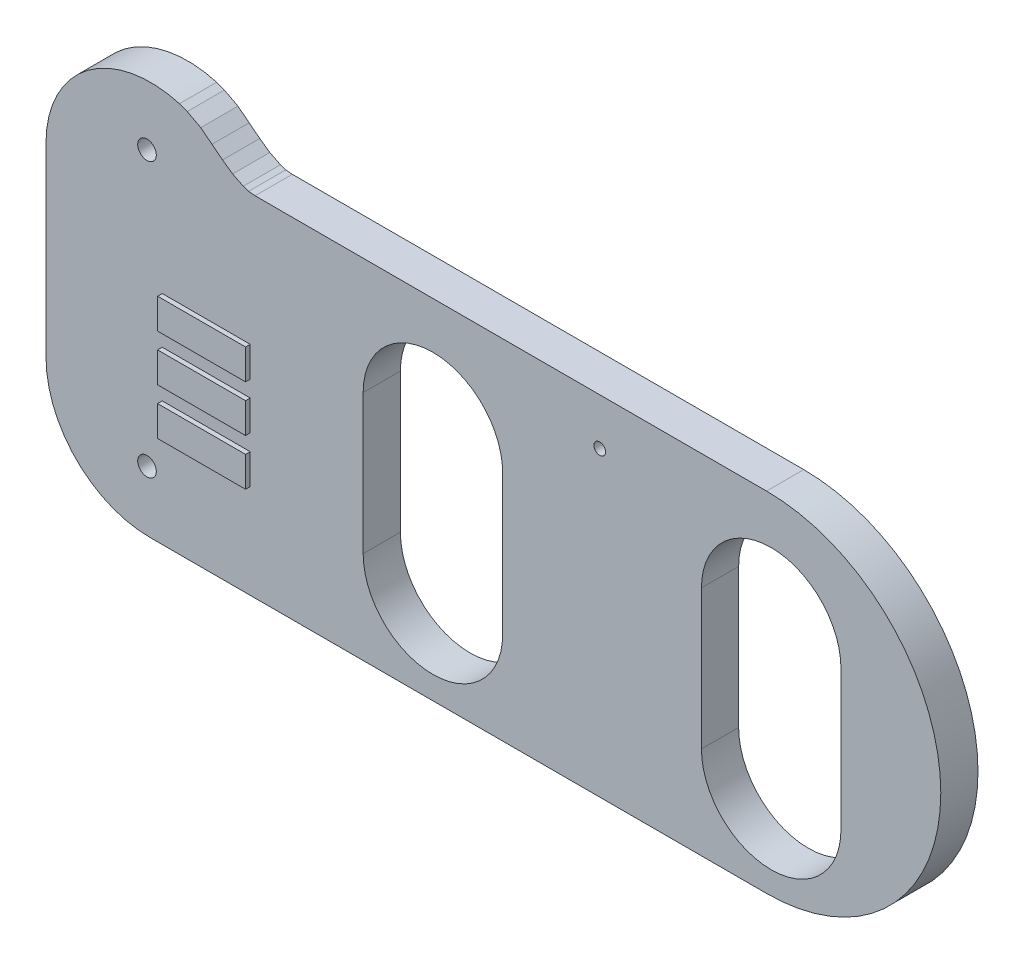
ISO-10303-21;
HEADER;
FILE_DESCRIPTION(('STEP AP214'),'2;1');
FILE_NAME('part.step','',(''),(''),'','','');
FILE_SCHEMA(('AUTOMOTIVE_DESIGN { 1 0 10303 214 1 1 1 1 }'));
ENDSEC;
DATA;
#1=APPLICATION_CONTEXT('core data for automotive mechanical design processes');
#2=APPLICATION_PROTOCOL_DEFINITION('international standard','automotive_design',2000,#1);
#3=PRODUCT_CONTEXT('',#1,'mechanical');
#4=PRODUCT('Part','Part','',(#3));
#5=PRODUCT_RELATED_PRODUCT_CATEGORY('part','',(#4));
#6=PRODUCT_DEFINITION_FORMATION('','',#4);
#7=PRODUCT_DEFINITION_CONTEXT('part definition',#1,'design');
#8=PRODUCT_DEFINITION('design','',#6,#7);
#9=PRODUCT_DEFINITION_SHAPE('','',#8);
#10=(LENGTH_UNIT() NAMED_UNIT(*) SI_UNIT(.MILLI.,.METRE.));
#11=(NAMED_UNIT(*) PLANE_ANGLE_UNIT() SI_UNIT($,.RADIAN.));
#12=(NAMED_UNIT(*) SI_UNIT($,.STERADIAN.) SOLID_ANGLE_UNIT());
#13=UNCERTAINTY_MEASURE_WITH_UNIT(LENGTH_MEASURE(1.E-05),#10,'distance_accuracy_value','');
#14=(GEOMETRIC_REPRESENTATION_CONTEXT(3) GLOBAL_UNCERTAINTY_ASSIGNED_CONTEXT((#13)) GLOBAL_UNIT_ASSIGNED_CONTEXT((#10,
#11,#12)) REPRESENTATION_CONTEXT('',''));
#15=CARTESIAN_POINT('',(0.,0.,0.));
#16=DIRECTION('',(0.,0.,1.));
#17=DIRECTION('',(1.,0.,0.));
#18=AXIS2_PLACEMENT_3D('',#15,#16,#17);
#19=CARTESIAN_POINT('',(-10.0383025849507,7.19083929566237,1.6));
#20=DIRECTION('',(-0.576683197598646,-0.816967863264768,0.));
#21=DIRECTION('',(0.816967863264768,-0.576683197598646,0.));
#22=AXIS2_PLACEMENT_3D('',#19,#20,#21);
#23=PLANE('',#22);
#24=DIRECTION('',(0.,0.,1.));
#25=VECTOR('',#24,1.);
#26=CARTESIAN_POINT('',(-10.4701025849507,7.49563929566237,1.6));
#27=LINE('',#26,#25);
#28=CARTESIAN_POINT('',(-10.4701025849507,7.49563929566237,0.));
#29=VERTEX_POINT('',#28);
#30=CARTESIAN_POINT('',(-10.4701025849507,7.49563929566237,1.6));
#31=VERTEX_POINT('',#30);
#32=EDGE_CURVE('E331',#29,#31,#27,.T.);
#33=ORIENTED_EDGE('',*,*,#32,.T.);
#34=DIRECTION('',(0.816967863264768,-0.576683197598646,0.));
#35=VECTOR('',#34,1.);
#36=CARTESIAN_POINT('',(-10.0383025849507,7.19083929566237,1.6));
#37=LINE('',#36,#35);
#38=CARTESIAN_POINT('',(-10.0383025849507,7.19083929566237,1.6));
#39=VERTEX_POINT('',#38);
#40=EDGE_CURVE('E341',#39,#31,#37,.F.);
#41=ORIENTED_EDGE('',*,*,#40,.F.);
#42=DIRECTION('',(0.,0.,1.));
#43=VECTOR('',#42,1.);
#44=CARTESIAN_POINT('',(-10.0383025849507,7.19083929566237,1.6));
#45=LINE('',#44,#43);
#46=CARTESIAN_POINT('',(-10.0383025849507,7.19083929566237,0.));
#47=VERTEX_POINT('',#46);
#48=EDGE_CURVE('E311',#39,#47,#45,.F.);
#49=ORIENTED_EDGE('',*,*,#48,.T.);
#50=DIRECTION('',(0.816967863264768,-0.576683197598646,0.));
#51=VECTOR('',#50,1.);
#52=CARTESIAN_POINT('',(-10.0383025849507,7.19083929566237,0.));
#53=LINE('',#52,#51);
#54=EDGE_CURVE('E338',#29,#47,#53,.T.);
#55=ORIENTED_EDGE('',*,*,#54,.F.);
#56=EDGE_LOOP('',(#33,#41,#49,#55));
#57=FACE_BOUND('',#56,.T.);
#58=ADVANCED_FACE('F17',(#57),#23,.F.);
#59=CARTESIAN_POINT('',(-10.4701025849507,7.49563929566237,1.6));
#60=DIRECTION('',(-0.613940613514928,-0.78935221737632,0.));
#61=DIRECTION('',(0.78935221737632,-0.613940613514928,0.));
#62=AXIS2_PLACEMENT_3D('',#59,#60,#61);
#63=PLANE('',#62);
#64=DIRECTION('',(0.,0.,1.));
#65=VECTOR('',#64,1.);
#66=CARTESIAN_POINT('',(-10.9273025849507,7.85123929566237,1.6));
#67=LINE('',#66,#65);
#68=CARTESIAN_POINT('',(-10.9273025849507,7.85123929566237,0.));
#69=VERTEX_POINT('',#68);
#70=CARTESIAN_POINT('',(-10.9273025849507,7.85123929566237,1.6));
#71=VERTEX_POINT('',#70);
#72=EDGE_CURVE('E301',#69,#71,#67,.T.);
#73=ORIENTED_EDGE('',*,*,#72,.T.);
#74=DIRECTION('',(0.78935221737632,-0.613940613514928,0.));
#75=VECTOR('',#74,1.);
#76=CARTESIAN_POINT('',(-10.4701025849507,7.49563929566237,1.6));
#77=LINE('',#76,#75);
#78=EDGE_CURVE('E326',#31,#71,#77,.F.);
#79=ORIENTED_EDGE('',*,*,#78,.F.);
#80=ORIENTED_EDGE('',*,*,#32,.F.);
#81=DIRECTION('',(0.78935221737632,-0.613940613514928,0.));
#82=VECTOR('',#81,1.);
#83=CARTESIAN_POINT('',(-10.4701025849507,7.49563929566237,0.));
#84=LINE('',#83,#82);
#85=EDGE_CURVE('E317',#69,#29,#84,.T.);
#86=ORIENTED_EDGE('',*,*,#85,.F.);
#87=EDGE_LOOP('',(#73,#79,#80,#86));
#88=FACE_BOUND('',#87,.T.);
#89=ADVANCED_FACE('F655',(#88),#63,.F.);
#90=CARTESIAN_POINT('',(-9.58110258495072,6.96223929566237,1.6));
#91=DIRECTION('',(-0.447213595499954,-0.894427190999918,0.));
#92=DIRECTION('',(0.894427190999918,-0.447213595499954,0.));
#93=AXIS2_PLACEMENT_3D('',#90,#91,#92);
#94=PLANE('',#93);
#95=ORIENTED_EDGE('',*,*,#48,.F.);
#96=DIRECTION('',(0.894427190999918,-0.447213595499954,0.));
#97=VECTOR('',#96,1.);
#98=CARTESIAN_POINT('',(-9.58110258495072,6.96223929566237,1.6));
#99=LINE('',#98,#97);
#100=CARTESIAN_POINT('',(-9.58110258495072,6.96223929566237,1.6));
#101=VERTEX_POINT('',#100);
#102=EDGE_CURVE('E314',#101,#39,#99,.F.);
#103=ORIENTED_EDGE('',*,*,#102,.F.);
#104=DIRECTION('',(0.,0.,1.));
#105=VECTOR('',#104,1.);
#106=CARTESIAN_POINT('',(-9.58110258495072,6.96223929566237,1.6));
#107=LINE('',#106,#105);
#108=CARTESIAN_POINT('',(-9.58110258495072,6.96223929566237,0.));
#109=VERTEX_POINT('',#108);
#110=EDGE_CURVE('E272',#101,#109,#107,.F.);
#111=ORIENTED_EDGE('',*,*,#110,.T.);
#112=DIRECTION('',(0.894427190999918,-0.447213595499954,0.));
#113=VECTOR('',#112,1.);
#114=CARTESIAN_POINT('',(-9.58110258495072,6.96223929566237,0.));
#115=LINE('',#114,#113);
#116=EDGE_CURVE('E308',#47,#109,#115,.T.);
#117=ORIENTED_EDGE('',*,*,#116,.F.);
#118=EDGE_LOOP('',(#95,#103,#111,#117));
#119=FACE_BOUND('',#118,.T.);
#120=ADVANCED_FACE('F652',(#119),#94,.F.);
#121=CARTESIAN_POINT('',(-10.9273025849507,7.85123929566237,1.6));
#122=DIRECTION('',(-0.61964428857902,-0.784882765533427,0.));
#123=DIRECTION('',(0.784882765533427,-0.61964428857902,0.));
#124=AXIS2_PLACEMENT_3D('',#121,#122,#123);
#125=PLANE('',#124);
#126=DIRECTION('',(0.,0.,1.));
#127=VECTOR('',#126,1.);
#128=CARTESIAN_POINT('',(-11.4099025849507,8.23223929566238,1.6));
#129=LINE('',#128,#127);
#130=CARTESIAN_POINT('',(-11.4099025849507,8.23223929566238,0.));
#131=VERTEX_POINT('',#130);
#132=CARTESIAN_POINT('',(-11.4099025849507,8.23223929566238,1.6));
#133=VERTEX_POINT('',#132);
#134=EDGE_CURVE('E266',#131,#133,#129,.T.);
#135=ORIENTED_EDGE('',*,*,#134,.T.);
#136=DIRECTION('',(0.784882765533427,-0.61964428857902,0.));
#137=VECTOR('',#136,1.);
#138=CARTESIAN_POINT('',(-10.9273025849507,7.85123929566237,1.6));
#139=LINE('',#138,#137);
#140=EDGE_CURVE('E296',#71,#133,#139,.F.);
#141=ORIENTED_EDGE('',*,*,#140,.F.);
#142=ORIENTED_EDGE('',*,*,#72,.F.);
#143=DIRECTION('',(0.784882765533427,-0.61964428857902,0.));
#144=VECTOR('',#143,1.);
#145=CARTESIAN_POINT('',(-10.9273025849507,7.85123929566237,0.));
#146=LINE('',#145,#144);
#147=EDGE_CURVE('E289',#131,#69,#146,.T.);
#148=ORIENTED_EDGE('',*,*,#147,.F.);
#149=EDGE_LOOP('',(#135,#141,#142,#148));
#150=FACE_BOUND('',#149,.T.);
#151=ADVANCED_FACE('F648',(#150),#125,.F.);
#152=CARTESIAN_POINT('',(0.,0.,1.8));
#153=DIRECTION('',(0.,0.,1.));
#154=DIRECTION('',(1.,0.,0.));
#155=AXIS2_PLACEMENT_3D('',#152,#153,#154);
#156=PLANE('',#155);
#157=DIRECTION('',(0.,1.,0.));
#158=VECTOR('',#157,1.);
#159=CARTESIAN_POINT('',(-13.0647025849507,0.,1.8));
#160=LINE('',#159,#158);
#161=CARTESIAN_POINT('',(-13.0647025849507,-0.775360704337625,1.8));
#162=VERTEX_POINT('',#161);
#163=CARTESIAN_POINT('',(-13.0647025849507,-2.07536070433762,1.8));
#164=VERTEX_POINT('',#163);
#165=EDGE_CURVE('E286',#162,#164,#160,.F.);
#166=ORIENTED_EDGE('',*,*,#165,.T.);
#167=DIRECTION('',(1.,0.,0.));
#168=VECTOR('',#167,1.);
#169=CARTESIAN_POINT('',(-13.0647025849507,-2.07536070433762,1.8));
#170=LINE('',#169,#168);
#171=CARTESIAN_POINT('',(-9.28227758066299,-2.07536070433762,1.8));
#172=VERTEX_POINT('',#171);
#173=EDGE_CURVE('E247',#164,#172,#170,.T.);
#174=ORIENTED_EDGE('',*,*,#173,.T.);
#175=DIRECTION('',(0.,1.,0.));
#176=VECTOR('',#175,1.);
#177=CARTESIAN_POINT('',(-9.28227758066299,-0.775360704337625,1.8));
#178=LINE('',#177,#176);
#179=CARTESIAN_POINT('',(-9.28227758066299,-0.775360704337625,1.8));
#180=VERTEX_POINT('',#179);
#181=EDGE_CURVE('E253',#172,#180,#178,.T.);
#182=ORIENTED_EDGE('',*,*,#181,.T.);
#183=DIRECTION('',(1.,0.,0.));
#184=VECTOR('',#183,1.);
#185=CARTESIAN_POINT('',(-13.0647025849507,-0.775360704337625,1.8));
#186=LINE('',#185,#184);
#187=EDGE_CURVE('E256',#180,#162,#186,.F.);
#188=ORIENTED_EDGE('',*,*,#187,.T.);
#189=EDGE_LOOP('',(#166,#174,#182,#188));
#190=FACE_BOUND('',#189,.T.);
#191=ADVANCED_FACE('F644',(#190),#156,.T.);
#192=CARTESIAN_POINT('',(0.,0.,1.8));
#193=DIRECTION('',(0.,0.,1.));
#194=DIRECTION('',(1.,0.,0.));
#195=AXIS2_PLACEMENT_3D('',#192,#193,#194);
#196=PLANE('',#195);
#197=DIRECTION('',(0.,1.,0.));
#198=VECTOR('',#197,1.);
#199=CARTESIAN_POINT('',(-13.0647025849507,0.,1.8));
#200=LINE('',#199,#198);
#201=CARTESIAN_POINT('',(-13.0647025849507,1.22463929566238,1.8));
#202=VERTEX_POINT('',#201);
#203=CARTESIAN_POINT('',(-13.0647025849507,-0.075360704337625,1.8));
#204=VERTEX_POINT('',#203);
#205=EDGE_CURVE('E283',#202,#204,#200,.F.);
#206=ORIENTED_EDGE('',*,*,#205,.T.);
#207=DIRECTION('',(1.,0.,0.));
#208=VECTOR('',#207,1.);
#209=CARTESIAN_POINT('',(-13.0647025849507,-0.075360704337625,1.8));
#210=LINE('',#209,#208);
#211=CARTESIAN_POINT('',(-9.28227758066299,-0.075360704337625,1.8));
#212=VERTEX_POINT('',#211);
#213=EDGE_CURVE('E217',#204,#212,#210,.T.);
#214=ORIENTED_EDGE('',*,*,#213,.T.);
#215=DIRECTION('',(0.,1.,0.));
#216=VECTOR('',#215,1.);
#217=CARTESIAN_POINT('',(-9.28227758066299,1.22463929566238,1.8));
#218=LINE('',#217,#216);
#219=CARTESIAN_POINT('',(-9.28227758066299,1.22463929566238,1.8));
#220=VERTEX_POINT('',#219);
#221=EDGE_CURVE('E223',#212,#220,#218,.T.);
#222=ORIENTED_EDGE('',*,*,#221,.T.);
#223=DIRECTION('',(1.,0.,0.));
#224=VECTOR('',#223,1.);
#225=CARTESIAN_POINT('',(-13.0647025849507,1.22463929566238,1.8));
#226=LINE('',#225,#224);
#227=EDGE_CURVE('E226',#220,#202,#226,.F.);
#228=ORIENTED_EDGE('',*,*,#227,.T.);
#229=EDGE_LOOP('',(#206,#214,#222,#228));
#230=FACE_BOUND('',#229,.T.);
#231=ADVANCED_FACE('F640',(#230),#196,.T.);
#232=CARTESIAN_POINT('',(0.,0.,1.8));
#233=DIRECTION('',(0.,0.,1.));
#234=DIRECTION('',(1.,0.,0.));
#235=AXIS2_PLACEMENT_3D('',#232,#233,#234);
#236=PLANE('',#235);
#237=DIRECTION('',(0.,1.,0.));
#238=VECTOR('',#237,1.);
#239=CARTESIAN_POINT('',(-13.0647025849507,0.,1.8));
#240=LINE('',#239,#238);
#241=CARTESIAN_POINT('',(-13.0647025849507,-2.77536070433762,1.8));
#242=VERTEX_POINT('',#241);
#243=CARTESIAN_POINT('',(-13.0647025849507,-4.07536070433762,1.8));
#244=VERTEX_POINT('',#243);
#245=EDGE_CURVE('E273',#242,#244,#240,.F.);
#246=ORIENTED_EDGE('',*,*,#245,.T.);
#247=DIRECTION('',(1.,0.,0.));
#248=VECTOR('',#247,1.);
#249=CARTESIAN_POINT('',(-13.0647025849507,-4.07536070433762,1.8));
#250=LINE('',#249,#248);
#251=CARTESIAN_POINT('',(-9.28227758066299,-4.07536070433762,1.8));
#252=VERTEX_POINT('',#251);
#253=EDGE_CURVE('E196',#244,#252,#250,.T.);
#254=ORIENTED_EDGE('',*,*,#253,.T.);
#255=DIRECTION('',(0.,1.,0.));
#256=VECTOR('',#255,1.);
#257=CARTESIAN_POINT('',(-9.28227758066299,-2.77536070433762,1.8));
#258=LINE('',#257,#256);
#259=CARTESIAN_POINT('',(-9.28227758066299,-2.77536070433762,1.8));
#260=VERTEX_POINT('',#259);
#261=EDGE_CURVE('E202',#252,#260,#258,.T.);
#262=ORIENTED_EDGE('',*,*,#261,.T.);
#263=DIRECTION('',(1.,0.,0.));
#264=VECTOR('',#263,1.);
#265=CARTESIAN_POINT('',(-13.0647025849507,-2.77536070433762,1.8));
#266=LINE('',#265,#264);
#267=EDGE_CURVE('E205',#260,#242,#266,.F.);
#268=ORIENTED_EDGE('',*,*,#267,.T.);
#269=EDGE_LOOP('',(#246,#254,#262,#268));
#270=FACE_BOUND('',#269,.T.);
#271=ADVANCED_FACE('F636',(#270),#236,.T.);
#272=CARTESIAN_POINT('',(-9.35250258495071,6.88603929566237,1.6));
#273=DIRECTION('',(-0.316227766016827,-0.948683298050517,0.));
#274=DIRECTION('',(0.948683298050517,-0.316227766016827,0.));
#275=AXIS2_PLACEMENT_3D('',#272,#273,#274);
#276=PLANE('',#275);
#277=ORIENTED_EDGE('',*,*,#110,.F.);
#278=DIRECTION('',(0.948683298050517,-0.316227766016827,0.));
#279=VECTOR('',#278,1.);
#280=CARTESIAN_POINT('',(-9.35250258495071,6.88603929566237,1.6));
#281=LINE('',#280,#279);
#282=CARTESIAN_POINT('',(-9.35250258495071,6.88603929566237,1.6));
#283=VERTEX_POINT('',#282);
#284=EDGE_CURVE('E269',#283,#101,#281,.F.);
#285=ORIENTED_EDGE('',*,*,#284,.F.);
#286=DIRECTION('',(0.,0.,1.));
#287=VECTOR('',#286,1.);
#288=CARTESIAN_POINT('',(-9.35250258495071,6.88603929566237,1.6));
#289=LINE('',#288,#287);
#290=CARTESIAN_POINT('',(-9.35250258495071,6.88603929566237,0.));
#291=VERTEX_POINT('',#290);
#292=EDGE_CURVE('E160',#283,#291,#289,.F.);
#293=ORIENTED_EDGE('',*,*,#292,.T.);
#294=DIRECTION('',(0.948683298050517,-0.316227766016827,0.));
#295=VECTOR('',#294,1.);
#296=CARTESIAN_POINT('',(-9.35250258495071,6.88603929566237,0.));
#297=LINE('',#296,#295);
#298=EDGE_CURVE('E276',#109,#291,#297,.T.);
#299=ORIENTED_EDGE('',*,*,#298,.F.);
#300=EDGE_LOOP('',(#277,#285,#293,#299));
#301=FACE_BOUND('',#300,.T.);
#302=ADVANCED_FACE('F632',(#301),#276,.F.);
#303=CARTESIAN_POINT('',(-11.4099025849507,8.23223929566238,1.6));
#304=DIRECTION('',(-0.462566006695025,-0.886584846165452,0.));
#305=DIRECTION('',(0.886584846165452,-0.462566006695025,0.));
#306=AXIS2_PLACEMENT_3D('',#303,#304,#305);
#307=PLANE('',#306);
#308=DIRECTION('',(0.,0.,1.));
#309=VECTOR('',#308,1.);
#310=CARTESIAN_POINT('',(-11.9941025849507,8.53703929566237,1.6));
#311=LINE('',#310,#309);
#312=CARTESIAN_POINT('',(-11.9941025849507,8.53703929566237,0.));
#313=VERTEX_POINT('',#312);
#314=CARTESIAN_POINT('',(-11.9941025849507,8.53703929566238,1.6));
#315=VERTEX_POINT('',#314);
#316=EDGE_CURVE('E159',#313,#315,#311,.T.);
#317=ORIENTED_EDGE('',*,*,#316,.T.);
#318=DIRECTION('',(0.886584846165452,-0.462566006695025,0.));
#319=VECTOR('',#318,1.);
#320=CARTESIAN_POINT('',(-11.4099025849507,8.23223929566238,1.6));
#321=LINE('',#320,#319);
#322=EDGE_CURVE('E262',#133,#315,#321,.F.);
#323=ORIENTED_EDGE('',*,*,#322,.F.);
#324=ORIENTED_EDGE('',*,*,#134,.F.);
#325=DIRECTION('',(0.886584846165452,-0.462566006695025,0.));
#326=VECTOR('',#325,1.);
#327=CARTESIAN_POINT('',(-11.4099025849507,8.23223929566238,0.));
#328=LINE('',#327,#326);
#329=EDGE_CURVE('E259',#313,#131,#328,.T.);
#330=ORIENTED_EDGE('',*,*,#329,.F.);
#331=EDGE_LOOP('',(#317,#323,#324,#330));
#332=FACE_BOUND('',#331,.T.);
#333=ADVANCED_FACE('F628',(#332),#307,.F.);
#334=CARTESIAN_POINT('',(-13.0647025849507,-0.775360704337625,1.8));
#335=DIRECTION('',(0.,-1.,0.));
#336=DIRECTION('',(1.,0.,0.));
#337=AXIS2_PLACEMENT_3D('',#334,#335,#336);
#338=PLANE('',#337);
#339=DIRECTION('',(0.,0.,-1.));
#340=VECTOR('',#339,1.);
#341=CARTESIAN_POINT('',(-13.0647025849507,-0.775360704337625,1.8));
#342=LINE('',#341,#340);
#343=CARTESIAN_POINT('',(-13.0647025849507,-0.775360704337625,1.6));
#344=VERTEX_POINT('',#343);
#345=EDGE_CURVE('E241',#344,#162,#342,.F.);
#346=ORIENTED_EDGE('',*,*,#345,.T.);
#347=ORIENTED_EDGE('',*,*,#187,.F.);
#348=DIRECTION('',(0.,0.,1.));
#349=VECTOR('',#348,1.);
#350=CARTESIAN_POINT('',(-9.28227758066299,-0.775360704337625,1.8));
#351=LINE('',#350,#349);
#352=CARTESIAN_POINT('',(-9.28227758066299,-0.775360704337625,1.6));
#353=VERTEX_POINT('',#352);
#354=EDGE_CURVE('E250',#180,#353,#351,.F.);
#355=ORIENTED_EDGE('',*,*,#354,.T.);
#356=DIRECTION('',(1.,0.,0.));
#357=VECTOR('',#356,1.);
#358=CARTESIAN_POINT('',(-13.5647778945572,-0.775360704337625,1.6));
#359=LINE('',#358,#357);
#360=EDGE_CURVE('E450',#344,#353,#359,.T.);
#361=ORIENTED_EDGE('',*,*,#360,.F.);
#362=EDGE_LOOP('',(#346,#347,#355,#361));
#363=FACE_BOUND('',#362,.T.);
#364=ADVANCED_FACE('F624',(#363),#338,.F.);
#365=CARTESIAN_POINT('',(-9.28227758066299,-0.775360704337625,1.8));
#366=DIRECTION('',(-1.,0.,0.));
#367=DIRECTION('',(0.,0.,1.));
#368=AXIS2_PLACEMENT_3D('',#365,#366,#367);
#369=PLANE('',#368);
#370=ORIENTED_EDGE('',*,*,#354,.F.);
#371=ORIENTED_EDGE('',*,*,#181,.F.);
#372=DIRECTION('',(0.,0.,1.));
#373=VECTOR('',#372,1.);
#374=CARTESIAN_POINT('',(-9.28227758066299,-2.07536070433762,1.8));
#375=LINE('',#374,#373);
#376=CARTESIAN_POINT('',(-9.28227758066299,-2.07536070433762,1.6));
#377=VERTEX_POINT('',#376);
#378=EDGE_CURVE('E244',#172,#377,#375,.F.);
#379=ORIENTED_EDGE('',*,*,#378,.T.);
#380=DIRECTION('',(0.,1.,0.));
#381=VECTOR('',#380,1.);
#382=CARTESIAN_POINT('',(-9.28227758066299,4.33847075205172,1.6));
#383=LINE('',#382,#381);
#384=EDGE_CURVE('E447',#353,#377,#383,.F.);
#385=ORIENTED_EDGE('',*,*,#384,.F.);
#386=EDGE_LOOP('',(#370,#371,#379,#385));
#387=FACE_BOUND('',#386,.T.);
#388=ADVANCED_FACE('F620',(#387),#369,.F.);
#389=CARTESIAN_POINT('',(-13.0647025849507,-2.07536070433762,1.8));
#390=DIRECTION('',(0.,1.,0.));
#391=DIRECTION('',(0.,0.,1.));
#392=AXIS2_PLACEMENT_3D('',#389,#390,#391);
#393=PLANE('',#392);
#394=ORIENTED_EDGE('',*,*,#378,.F.);
#395=ORIENTED_EDGE('',*,*,#173,.F.);
#396=DIRECTION('',(0.,0.,-1.));
#397=VECTOR('',#396,1.);
#398=CARTESIAN_POINT('',(-13.0647025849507,-2.07536070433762,1.8));
#399=LINE('',#398,#397);
#400=CARTESIAN_POINT('',(-13.0647025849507,-2.07536070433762,1.6));
#401=VERTEX_POINT('',#400);
#402=EDGE_CURVE('E229',#164,#401,#399,.T.);
#403=ORIENTED_EDGE('',*,*,#402,.T.);
#404=DIRECTION('',(1.,0.,0.));
#405=VECTOR('',#404,1.);
#406=CARTESIAN_POINT('',(-13.5647778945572,-2.07536070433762,1.6));
#407=LINE('',#406,#405);
#408=EDGE_CURVE('E444',#377,#401,#407,.F.);
#409=ORIENTED_EDGE('',*,*,#408,.F.);
#410=EDGE_LOOP('',(#394,#395,#403,#409));
#411=FACE_BOUND('',#410,.T.);
#412=ADVANCED_FACE('F616',(#411),#393,.F.);
#413=CARTESIAN_POINT('',(-13.0647025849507,-0.775360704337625,1.8));
#414=DIRECTION('',(1.,0.,0.));
#415=DIRECTION('',(0.,0.,-1.));
#416=AXIS2_PLACEMENT_3D('',#413,#414,#415);
#417=PLANE('',#416);
#418=ORIENTED_EDGE('',*,*,#402,.F.);
#419=ORIENTED_EDGE('',*,*,#165,.F.);
#420=ORIENTED_EDGE('',*,*,#345,.F.);
#421=DIRECTION('',(0.,1.,0.));
#422=VECTOR('',#421,1.);
#423=CARTESIAN_POINT('',(-13.0647025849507,4.33847075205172,1.6));
#424=LINE('',#423,#422);
#425=EDGE_CURVE('E174',#401,#344,#424,.T.);
#426=ORIENTED_EDGE('',*,*,#425,.F.);
#427=EDGE_LOOP('',(#418,#419,#420,#426));
#428=FACE_BOUND('',#427,.T.);
#429=ADVANCED_FACE('F612',(#428),#417,.F.);
#430=CARTESIAN_POINT('',(-13.0647025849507,1.22463929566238,1.8));
#431=DIRECTION('',(0.,-1.,0.));
#432=DIRECTION('',(0.,0.,-1.));
#433=AXIS2_PLACEMENT_3D('',#430,#431,#432);
#434=PLANE('',#433);
#435=DIRECTION('',(0.,0.,1.));
#436=VECTOR('',#435,1.);
#437=CARTESIAN_POINT('',(-13.0647025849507,1.22463929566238,1.8));
#438=LINE('',#437,#436);
#439=CARTESIAN_POINT('',(-13.0647025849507,1.22463929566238,1.6));
#440=VERTEX_POINT('',#439);
#441=EDGE_CURVE('E211',#440,#202,#438,.T.);
#442=ORIENTED_EDGE('',*,*,#441,.T.);
#443=ORIENTED_EDGE('',*,*,#227,.F.);
#444=DIRECTION('',(0.,0.,1.));
#445=VECTOR('',#444,1.);
#446=CARTESIAN_POINT('',(-9.28227758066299,1.22463929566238,1.8));
#447=LINE('',#446,#445);
#448=CARTESIAN_POINT('',(-9.28227758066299,1.22463929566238,1.6));
#449=VERTEX_POINT('',#448);
#450=EDGE_CURVE('E220',#220,#449,#447,.F.);
#451=ORIENTED_EDGE('',*,*,#450,.T.);
#452=DIRECTION('',(1.,0.,0.));
#453=VECTOR('',#452,1.);
#454=CARTESIAN_POINT('',(-13.5647778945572,1.22463929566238,1.6));
#455=LINE('',#454,#453);
#456=EDGE_CURVE('E436',#440,#449,#455,.T.);
#457=ORIENTED_EDGE('',*,*,#456,.F.);
#458=EDGE_LOOP('',(#442,#443,#451,#457));
#459=FACE_BOUND('',#458,.T.);
#460=ADVANCED_FACE('F608',(#459),#434,.F.);
#461=CARTESIAN_POINT('',(-9.28227758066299,1.22463929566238,1.8));
#462=DIRECTION('',(-1.,0.,0.));
#463=DIRECTION('',(0.,0.,1.));
#464=AXIS2_PLACEMENT_3D('',#461,#462,#463);
#465=PLANE('',#464);
#466=ORIENTED_EDGE('',*,*,#450,.F.);
#467=ORIENTED_EDGE('',*,*,#221,.F.);
#468=DIRECTION('',(0.,0.,1.));
#469=VECTOR('',#468,1.);
#470=CARTESIAN_POINT('',(-9.28227758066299,-0.075360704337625,1.8));
#471=LINE('',#470,#469);
#472=CARTESIAN_POINT('',(-9.28227758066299,-0.0753607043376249,1.6));
#473=VERTEX_POINT('',#472);
#474=EDGE_CURVE('E214',#212,#473,#471,.F.);
#475=ORIENTED_EDGE('',*,*,#474,.T.);
#476=DIRECTION('',(0.,1.,0.));
#477=VECTOR('',#476,1.);
#478=CARTESIAN_POINT('',(-9.28227758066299,4.33847075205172,1.6));
#479=LINE('',#478,#477);
#480=EDGE_CURVE('E433',#449,#473,#479,.F.);
#481=ORIENTED_EDGE('',*,*,#480,.F.);
#482=EDGE_LOOP('',(#466,#467,#475,#481));
#483=FACE_BOUND('',#482,.T.);
#484=ADVANCED_FACE('F604',(#483),#465,.F.);
#485=CARTESIAN_POINT('',(-13.0647025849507,-0.075360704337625,1.8));
#486=DIRECTION('',(0.,1.,0.));
#487=DIRECTION('',(0.,0.,1.));
#488=AXIS2_PLACEMENT_3D('',#485,#486,#487);
#489=PLANE('',#488);
#490=ORIENTED_EDGE('',*,*,#474,.F.);
#491=ORIENTED_EDGE('',*,*,#213,.F.);
#492=DIRECTION('',(0.,0.,1.));
#493=VECTOR('',#492,1.);
#494=CARTESIAN_POINT('',(-13.0647025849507,-0.0753607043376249,1.8));
#495=LINE('',#494,#493);
#496=CARTESIAN_POINT('',(-13.0647025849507,-0.0753607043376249,1.6));
#497=VERTEX_POINT('',#496);
#498=EDGE_CURVE('E208',#204,#497,#495,.F.);
#499=ORIENTED_EDGE('',*,*,#498,.T.);
#500=DIRECTION('',(1.,0.,0.));
#501=VECTOR('',#500,1.);
#502=CARTESIAN_POINT('',(-13.5647778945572,-0.0753607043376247,1.6));
#503=LINE('',#502,#501);
#504=EDGE_CURVE('E430',#473,#497,#503,.F.);
#505=ORIENTED_EDGE('',*,*,#504,.F.);
#506=EDGE_LOOP('',(#490,#491,#499,#505));
#507=FACE_BOUND('',#506,.T.);
#508=ADVANCED_FACE('F600',(#507),#489,.F.);
#509=CARTESIAN_POINT('',(-13.0647025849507,1.22463929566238,1.8));
#510=DIRECTION('',(1.,0.,0.));
#511=DIRECTION('',(0.,1.,0.));
#512=AXIS2_PLACEMENT_3D('',#509,#510,#511);
#513=PLANE('',#512);
#514=ORIENTED_EDGE('',*,*,#498,.F.);
#515=ORIENTED_EDGE('',*,*,#205,.F.);
#516=ORIENTED_EDGE('',*,*,#441,.F.);
#517=DIRECTION('',(0.,1.,0.));
#518=VECTOR('',#517,1.);
#519=CARTESIAN_POINT('',(-13.0647025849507,4.33847075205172,1.6));
#520=LINE('',#519,#518);
#521=EDGE_CURVE('E427',#497,#440,#520,.T.);
#522=ORIENTED_EDGE('',*,*,#521,.F.);
#523=EDGE_LOOP('',(#514,#515,#516,#522));
#524=FACE_BOUND('',#523,.T.);
#525=ADVANCED_FACE('F596',(#524),#513,.F.);
#526=CARTESIAN_POINT('',(-13.0647025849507,-2.77536070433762,1.8));
#527=DIRECTION('',(0.,-1.,0.));
#528=DIRECTION('',(0.,0.,-1.));
#529=AXIS2_PLACEMENT_3D('',#526,#527,#528);
#530=PLANE('',#529);
#531=DIRECTION('',(0.,0.,-1.));
#532=VECTOR('',#531,1.);
#533=CARTESIAN_POINT('',(-13.0647025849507,-2.77536070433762,1.8));
#534=LINE('',#533,#532);
#535=CARTESIAN_POINT('',(-13.0647025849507,-2.77536070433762,1.6));
#536=VERTEX_POINT('',#535);
#537=EDGE_CURVE('E190',#536,#242,#534,.F.);
#538=ORIENTED_EDGE('',*,*,#537,.T.);
#539=ORIENTED_EDGE('',*,*,#267,.F.);
#540=DIRECTION('',(0.,0.,1.));
#541=VECTOR('',#540,1.);
#542=CARTESIAN_POINT('',(-9.28227758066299,-2.77536070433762,1.8));
#543=LINE('',#542,#541);
#544=CARTESIAN_POINT('',(-9.28227758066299,-2.77536070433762,1.6));
#545=VERTEX_POINT('',#544);
#546=EDGE_CURVE('E199',#260,#545,#543,.F.);
#547=ORIENTED_EDGE('',*,*,#546,.T.);
#548=DIRECTION('',(1.,0.,0.));
#549=VECTOR('',#548,1.);
#550=CARTESIAN_POINT('',(-13.5647778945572,-2.77536070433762,1.6));
#551=LINE('',#550,#549);
#552=EDGE_CURVE('E424',#536,#545,#551,.T.);
#553=ORIENTED_EDGE('',*,*,#552,.F.);
#554=EDGE_LOOP('',(#538,#539,#547,#553));
#555=FACE_BOUND('',#554,.T.);
#556=ADVANCED_FACE('F592',(#555),#530,.F.);
#557=CARTESIAN_POINT('',(-9.28227758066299,-2.77536070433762,1.8));
#558=DIRECTION('',(-1.,0.,0.));
#559=DIRECTION('',(0.,0.,1.));
#560=AXIS2_PLACEMENT_3D('',#557,#558,#559);
#561=PLANE('',#560);
#562=ORIENTED_EDGE('',*,*,#546,.F.);
#563=ORIENTED_EDGE('',*,*,#261,.F.);
#564=DIRECTION('',(0.,0.,1.));
#565=VECTOR('',#564,1.);
#566=CARTESIAN_POINT('',(-9.28227758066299,-4.07536070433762,1.8));
#567=LINE('',#566,#565);
#568=CARTESIAN_POINT('',(-9.28227758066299,-4.07536070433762,1.6));
#569=VERTEX_POINT('',#568);
#570=EDGE_CURVE('E193',#252,#569,#567,.F.);
#571=ORIENTED_EDGE('',*,*,#570,.T.);
#572=DIRECTION('',(0.,1.,0.));
#573=VECTOR('',#572,1.);
#574=CARTESIAN_POINT('',(-9.28227758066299,4.33847075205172,1.6));
#575=LINE('',#574,#573);
#576=EDGE_CURVE('E421',#545,#569,#575,.F.);
#577=ORIENTED_EDGE('',*,*,#576,.F.);
#578=EDGE_LOOP('',(#562,#563,#571,#577));
#579=FACE_BOUND('',#578,.T.);
#580=ADVANCED_FACE('F588',(#579),#561,.F.);
#581=CARTESIAN_POINT('',(-13.0647025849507,-4.07536070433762,1.8));
#582=DIRECTION('',(0.,1.,0.));
#583=DIRECTION('',(0.,0.,1.));
#584=AXIS2_PLACEMENT_3D('',#581,#582,#583);
#585=PLANE('',#584);
#586=ORIENTED_EDGE('',*,*,#570,.F.);
#587=ORIENTED_EDGE('',*,*,#253,.F.);
#588=DIRECTION('',(0.,0.,-1.));
#589=VECTOR('',#588,1.);
#590=CARTESIAN_POINT('',(-13.0647025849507,-4.07536070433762,1.8));
#591=LINE('',#590,#589);
#592=CARTESIAN_POINT('',(-13.0647025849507,-4.07536070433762,1.6));
#593=VERTEX_POINT('',#592);
#594=EDGE_CURVE('E187',#244,#593,#591,.T.);
#595=ORIENTED_EDGE('',*,*,#594,.T.);
#596=DIRECTION('',(1.,0.,0.));
#597=VECTOR('',#596,1.);
#598=CARTESIAN_POINT('',(-13.5647778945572,-4.07536070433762,1.6));
#599=LINE('',#598,#597);
#600=EDGE_CURVE('E418',#569,#593,#599,.F.);
#601=ORIENTED_EDGE('',*,*,#600,.F.);
#602=EDGE_LOOP('',(#586,#587,#595,#601));
#603=FACE_BOUND('',#602,.T.);
#604=ADVANCED_FACE('F584',(#603),#585,.F.);
#605=CARTESIAN_POINT('',(-13.0647025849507,-2.77536070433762,1.8));
#606=DIRECTION('',(1.,0.,0.));
#607=DIRECTION('',(0.,0.,-1.));
#608=AXIS2_PLACEMENT_3D('',#605,#606,#607);
#609=PLANE('',#608);
#610=ORIENTED_EDGE('',*,*,#594,.F.);
#611=ORIENTED_EDGE('',*,*,#245,.F.);
#612=ORIENTED_EDGE('',*,*,#537,.F.);
#613=DIRECTION('',(0.,1.,0.));
#614=VECTOR('',#613,1.);
#615=CARTESIAN_POINT('',(-13.0647025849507,4.33847075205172,1.6));
#616=LINE('',#615,#614);
#617=EDGE_CURVE('E415',#593,#536,#616,.T.);
#618=ORIENTED_EDGE('',*,*,#617,.F.);
#619=EDGE_LOOP('',(#610,#611,#612,#618));
#620=FACE_BOUND('',#619,.T.);
#621=ADVANCED_FACE('F580',(#620),#609,.F.);
#622=CARTESIAN_POINT('',(-9.07310258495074,6.86063929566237,1.6));
#623=DIRECTION('',(-0.0905357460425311,-0.995893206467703,0.));
#624=DIRECTION('',(0.995893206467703,-0.0905357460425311,0.));
#625=AXIS2_PLACEMENT_3D('',#622,#623,#624);
#626=PLANE('',#625);
#627=ORIENTED_EDGE('',*,*,#292,.F.);
#628=DIRECTION('',(-0.995893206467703,0.0905357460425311,0.));
#629=VECTOR('',#628,1.);
#630=CARTESIAN_POINT('',(-9.07310258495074,6.86063929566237,1.6));
#631=LINE('',#630,#629);
#632=CARTESIAN_POINT('',(-9.07310258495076,6.86063929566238,1.6));
#633=VERTEX_POINT('',#632);
#634=EDGE_CURVE('E170',#633,#283,#631,.T.);
#635=ORIENTED_EDGE('',*,*,#634,.F.);
#636=DIRECTION('',(0.,0.,-1.));
#637=VECTOR('',#636,1.);
#638=CARTESIAN_POINT('',(-9.07310258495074,6.86063929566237,1.6));
#639=LINE('',#638,#637);
#640=CARTESIAN_POINT('',(-9.07310258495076,6.86063929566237,0.));
#641=VERTEX_POINT('',#640);
#642=EDGE_CURVE('E166',#633,#641,#639,.T.);
#643=ORIENTED_EDGE('',*,*,#642,.T.);
#644=DIRECTION('',(0.995893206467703,-0.0905357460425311,0.));
#645=VECTOR('',#644,1.);
#646=CARTESIAN_POINT('',(-9.07310258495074,6.86063929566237,0.));
#647=LINE('',#646,#645);
#648=EDGE_CURVE('E156',#291,#641,#647,.T.);
#649=ORIENTED_EDGE('',*,*,#648,.F.);
#650=EDGE_LOOP('',(#627,#635,#643,#649));
#651=FACE_BOUND('',#650,.T.);
#652=ADVANCED_FACE('F574',(#651),#626,.F.);
#653=CARTESIAN_POINT('',(-11.9941025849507,8.53703929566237,1.6));
#654=DIRECTION('',(-0.35897907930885,-0.933345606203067,0.));
#655=DIRECTION('',(0.933345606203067,-0.35897907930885,0.));
#656=AXIS2_PLACEMENT_3D('',#653,#654,#655);
#657=PLANE('',#656);
#658=DIRECTION('',(0.,0.,-1.));
#659=VECTOR('',#658,1.);
#660=CARTESIAN_POINT('',(-12.3243025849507,8.66403929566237,1.6));
#661=LINE('',#660,#659);
#662=CARTESIAN_POINT('',(-12.3243025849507,8.66403929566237,1.6));
#663=VERTEX_POINT('',#662);
#664=CARTESIAN_POINT('',(-12.3243025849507,8.66403929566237,0.));
#665=VERTEX_POINT('',#664);
#666=EDGE_CURVE('E398',#663,#665,#661,.T.);
#667=ORIENTED_EDGE('',*,*,#666,.F.);
#668=DIRECTION('',(-0.933345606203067,0.35897907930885,0.));
#669=VECTOR('',#668,1.);
#670=CARTESIAN_POINT('',(-11.9941025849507,8.53703929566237,1.6));
#671=LINE('',#670,#669);
#672=EDGE_CURVE('E173',#315,#663,#671,.T.);
#673=ORIENTED_EDGE('',*,*,#672,.F.);
#674=ORIENTED_EDGE('',*,*,#316,.F.);
#675=DIRECTION('',(0.933345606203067,-0.35897907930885,0.));
#676=VECTOR('',#675,1.);
#677=CARTESIAN_POINT('',(-11.9941025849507,8.53703929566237,0.));
#678=LINE('',#677,#676);
#679=EDGE_CURVE('E232',#665,#313,#678,.T.);
#680=ORIENTED_EDGE('',*,*,#679,.F.);
#681=EDGE_LOOP('',(#667,#673,#674,#680));
#682=FACE_BOUND('',#681,.T.);
#683=ADVANCED_FACE('F471',(#682),#657,.F.);
#684=CARTESIAN_POINT('',(-13.5647778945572,4.33847075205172,1.6));
#685=DIRECTION('',(0.,0.,1.));
#686=DIRECTION('',(1.,0.,0.));
#687=AXIS2_PLACEMENT_3D('',#684,#685,#686);
#688=PLANE('',#687);
#689=ORIENTED_EDGE('',*,*,#600,.T.);
#690=ORIENTED_EDGE('',*,*,#617,.T.);
#691=ORIENTED_EDGE('',*,*,#552,.T.);
#692=ORIENTED_EDGE('',*,*,#576,.T.);
#693=EDGE_LOOP('',(#689,#690,#691,#692));
#694=FACE_BOUND('',#693,.T.);
#695=ORIENTED_EDGE('',*,*,#504,.T.);
#696=ORIENTED_EDGE('',*,*,#521,.T.);
#697=ORIENTED_EDGE('',*,*,#456,.T.);
#698=ORIENTED_EDGE('',*,*,#480,.T.);
#699=EDGE_LOOP('',(#695,#696,#697,#698));
#700=FACE_BOUND('',#699,.T.);
#701=CARTESIAN_POINT('',(-13.7213025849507,6.25143787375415,1.6));
#702=DIRECTION('',(0.,0.,-1.));
#703=DIRECTION('',(-1.,0.,0.));
#704=AXIS2_PLACEMENT_3D('',#701,#702,#703);
#705=CIRCLE('',#704,0.399999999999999);
#706=CARTESIAN_POINT('',(-14.1213025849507,6.25143787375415,1.6));
#707=VERTEX_POINT('',#706);
#708=EDGE_CURVE('E20',#707,#707,#705,.T.);
#709=ORIENTED_EDGE('',*,*,#708,.T.);
#710=EDGE_LOOP('',(#709));
#711=FACE_BOUND('',#710,.T.);
#712=DIRECTION('',(0.,1.,0.));
#713=VECTOR('',#712,1.);
#714=CARTESIAN_POINT('',(16.1231643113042,-4.14316070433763,1.6));
#715=LINE('',#714,#713);
#716=CARTESIAN_POINT('',(16.1231643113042,-4.14316070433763,1.6));
#717=VERTEX_POINT('',#716);
#718=CARTESIAN_POINT('',(16.1231643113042,1.85683929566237,1.6));
#719=VERTEX_POINT('',#718);
#720=EDGE_CURVE('E180',#717,#719,#715,.T.);
#721=ORIENTED_EDGE('',*,*,#720,.F.);
#722=CARTESIAN_POINT('',(13.1231643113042,-4.14316070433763,1.6));
#723=DIRECTION('',(0.,0.,-1.));
#724=DIRECTION('',(-1.,0.,0.));
#725=AXIS2_PLACEMENT_3D('',#722,#723,#724);
#726=CIRCLE('',#725,3.);
#727=CARTESIAN_POINT('',(10.1231643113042,-4.14316070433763,1.6));
#728=VERTEX_POINT('',#727);
#729=EDGE_CURVE('E186',#717,#728,#726,.T.);
#730=ORIENTED_EDGE('',*,*,#729,.T.);
#731=DIRECTION('',(0.,1.,0.));
#732=VECTOR('',#731,1.);
#733=CARTESIAN_POINT('',(10.1231643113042,1.85683929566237,1.6));
#734=LINE('',#733,#732);
#735=CARTESIAN_POINT('',(10.1231643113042,1.85683929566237,1.6));
#736=VERTEX_POINT('',#735);
#737=EDGE_CURVE('E183',#736,#728,#734,.F.);
#738=ORIENTED_EDGE('',*,*,#737,.F.);
#739=CARTESIAN_POINT('',(13.1231643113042,1.85683929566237,1.6));
#740=DIRECTION('',(0.,0.,-1.));
#741=DIRECTION('',(-1.,0.,0.));
#742=AXIS2_PLACEMENT_3D('',#739,#740,#741);
#743=CIRCLE('',#742,3.);
#744=EDGE_CURVE('E150',#736,#719,#743,.T.);
#745=ORIENTED_EDGE('',*,*,#744,.T.);
#746=EDGE_LOOP('',(#721,#730,#738,#745));
#747=FACE_BOUND('',#746,.T.);
#748=ORIENTED_EDGE('',*,*,#322,.T.);
#749=ORIENTED_EDGE('',*,*,#672,.T.);
#750=CARTESIAN_POINT('',(-13.5647778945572,4.33847075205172,1.6));
#751=DIRECTION('',(0.,0.,-1.));
#752=DIRECTION('',(-1.,0.,0.));
#753=AXIS2_PLACEMENT_3D('',#750,#751,#752);
#754=CIRCLE('',#753,4.49992469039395);
#755=CARTESIAN_POINT('',(-18.0647025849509,4.33847075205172,1.6));
#756=VERTEX_POINT('',#755);
#757=EDGE_CURVE('E146',#756,#663,#754,.T.);
#758=ORIENTED_EDGE('',*,*,#757,.F.);
#759=DIRECTION('',(0.,1.,0.));
#760=VECTOR('',#759,1.);
#761=CARTESIAN_POINT('',(-18.0647025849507,4.33847257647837,1.6));
#762=LINE('',#761,#760);
#763=CARTESIAN_POINT('',(-18.0647025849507,-3.62956070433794,1.6));
#764=VERTEX_POINT('',#763);
#765=EDGE_CURVE('E137',#756,#764,#762,.F.);
#766=ORIENTED_EDGE('',*,*,#765,.T.);
#767=CARTESIAN_POINT('',(-13.5969166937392,-3.6575748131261,1.6));
#768=DIRECTION('',(0.,0.,-1.));
#769=DIRECTION('',(-1.,0.,0.));
#770=AXIS2_PLACEMENT_3D('',#767,#768,#769);
#771=CIRCLE('',#770,4.46787371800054);
#772=CARTESIAN_POINT('',(-13.568902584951,-8.12536070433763,1.6));
#773=VERTEX_POINT('',#772);
#774=EDGE_CURVE('E122',#773,#764,#771,.T.);
#775=ORIENTED_EDGE('',*,*,#774,.F.);
#776=DIRECTION('',(1.,0.,0.));
#777=VECTOR('',#776,1.);
#778=CARTESIAN_POINT('',(-13.5689025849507,-8.12536070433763,1.6));
#779=LINE('',#778,#777);
#780=CARTESIAN_POINT('',(12.9232974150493,-8.12536070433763,1.6));
#781=VERTEX_POINT('',#780);
#782=EDGE_CURVE('E177',#773,#781,#779,.T.);
#783=ORIENTED_EDGE('',*,*,#782,.T.);
#784=CARTESIAN_POINT('',(12.9232974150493,-0.632360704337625,1.6));
#785=DIRECTION('',(0.,0.,-1.));
#786=DIRECTION('',(-1.,0.,0.));
#787=AXIS2_PLACEMENT_3D('',#784,#785,#786);
#788=CIRCLE('',#787,7.493);
#789=CARTESIAN_POINT('',(12.9232974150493,6.86063929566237,1.6));
#790=VERTEX_POINT('',#789);
#791=EDGE_CURVE('E179',#790,#781,#788,.T.);
#792=ORIENTED_EDGE('',*,*,#791,.F.);
#793=DIRECTION('',(1.,0.,0.));
#794=VECTOR('',#793,1.);
#795=CARTESIAN_POINT('',(12.9232974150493,6.86063929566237,1.6));
#796=LINE('',#795,#794);
#797=EDGE_CURVE('E163',#790,#633,#796,.F.);
#798=ORIENTED_EDGE('',*,*,#797,.T.);
#799=ORIENTED_EDGE('',*,*,#634,.T.);
#800=ORIENTED_EDGE('',*,*,#284,.T.);
#801=ORIENTED_EDGE('',*,*,#102,.T.);
#802=ORIENTED_EDGE('',*,*,#40,.T.);
#803=ORIENTED_EDGE('',*,*,#78,.T.);
#804=ORIENTED_EDGE('',*,*,#140,.T.);
#805=EDGE_LOOP('',(#748,#749,#758,#766,#775,#783,#792,#798,#799,#800,#801,#802,#803,#804));
#806=FACE_BOUND('',#805,.T.);
#807=DIRECTION('',(0.,-1.,0.));
#808=VECTOR('',#807,1.);
#809=CARTESIAN_POINT('',(1.5750974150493,-4.14316070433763,1.6));
#810=LINE('',#809,#808);
#811=CARTESIAN_POINT('',(1.5750974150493,-4.14316070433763,1.6));
#812=VERTEX_POINT('',#811);
#813=CARTESIAN_POINT('',(1.57509741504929,1.85683929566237,1.6));
#814=VERTEX_POINT('',#813);
#815=EDGE_CURVE('E453',#812,#814,#810,.F.);
#816=ORIENTED_EDGE('',*,*,#815,.F.);
#817=CARTESIAN_POINT('',(-1.4249025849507,-4.14316070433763,1.6));
#818=DIRECTION('',(0.,0.,-1.));
#819=DIRECTION('',(-1.,0.,0.));
#820=AXIS2_PLACEMENT_3D('',#817,#818,#819);
#821=CIRCLE('',#820,3.);
#822=CARTESIAN_POINT('',(-4.42490258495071,-4.14316070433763,1.6));
#823=VERTEX_POINT('',#822);
#824=EDGE_CURVE('E392',#812,#823,#821,.T.);
#825=ORIENTED_EDGE('',*,*,#824,.T.);
#826=DIRECTION('',(0.,1.,0.));
#827=VECTOR('',#826,1.);
#828=CARTESIAN_POINT('',(-4.42490258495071,1.85683929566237,1.6));
#829=LINE('',#828,#827);
#830=CARTESIAN_POINT('',(-4.42490258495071,1.85683929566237,1.6));
#831=VERTEX_POINT('',#830);
#832=EDGE_CURVE('E395',#831,#823,#829,.F.);
#833=ORIENTED_EDGE('',*,*,#832,.F.);
#834=CARTESIAN_POINT('',(-1.42490258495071,1.85683929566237,1.6));
#835=DIRECTION('',(0.,0.,-1.));
#836=DIRECTION('',(-1.,0.,0.));
#837=AXIS2_PLACEMENT_3D('',#834,#835,#836);
#838=CIRCLE('',#837,3.);
#839=EDGE_CURVE('E389',#831,#814,#838,.T.);
#840=ORIENTED_EDGE('',*,*,#839,.T.);
#841=EDGE_LOOP('',(#816,#825,#833,#840));
#842=FACE_BOUND('',#841,.T.);
#843=CARTESIAN_POINT('',(5.74779741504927,4.85443787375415,1.6));
#844=DIRECTION('',(0.,0.,-1.));
#845=DIRECTION('',(-1.,0.,0.));
#846=AXIS2_PLACEMENT_3D('',#843,#844,#845);
#847=CIRCLE('',#846,0.25);
#848=CARTESIAN_POINT('',(5.49779741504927,4.85443787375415,1.6));
#849=VERTEX_POINT('',#848);
#850=EDGE_CURVE('E385',#849,#849,#847,.T.);
#851=ORIENTED_EDGE('',*,*,#850,.T.);
#852=EDGE_LOOP('',(#851));
#853=FACE_BOUND('',#852,.T.);
#854=CARTESIAN_POINT('',(-13.7213025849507,-5.53416212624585,1.6));
#855=DIRECTION('',(0.,0.,-1.));
#856=DIRECTION('',(-1.,0.,0.));
#857=AXIS2_PLACEMENT_3D('',#854,#855,#856);
#858=CIRCLE('',#857,0.399999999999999);
#859=CARTESIAN_POINT('',(-14.1213025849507,-5.53416212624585,1.6));
#860=VERTEX_POINT('',#859);
#861=EDGE_CURVE('E382',#860,#860,#858,.T.);
#862=ORIENTED_EDGE('',*,*,#861,.T.);
#863=EDGE_LOOP('',(#862));
#864=FACE_BOUND('',#863,.T.);
#865=ORIENTED_EDGE('',*,*,#408,.T.);
#866=ORIENTED_EDGE('',*,*,#425,.T.);
#867=ORIENTED_EDGE('',*,*,#360,.T.);
#868=ORIENTED_EDGE('',*,*,#384,.T.);
#869=EDGE_LOOP('',(#865,#866,#867,#868));
#870=FACE_BOUND('',#869,.T.);
#871=ADVANCED_FACE('F143',(#694,#700,#711,#747,#806,#842,#853,#864,#870),#688,.T.);
#872=CARTESIAN_POINT('',(-13.7213025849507,6.25143787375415,1.6));
#873=DIRECTION('',(0.,0.,-1.));
#874=DIRECTION('',(-1.,0.,0.));
#875=AXIS2_PLACEMENT_3D('',#872,#873,#874);
#876=CYLINDRICAL_SURFACE('',#875,0.399999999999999);
#877=CARTESIAN_POINT('',(-13.7213025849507,6.25143787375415,0.));
#878=DIRECTION('',(0.,0.,-1.));
#879=DIRECTION('',(-1.,0.,0.));
#880=AXIS2_PLACEMENT_3D('',#877,#878,#879);
#881=CIRCLE('',#880,0.399999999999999);
#882=CARTESIAN_POINT('',(-14.1213025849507,6.25143787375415,0.));
#883=VERTEX_POINT('',#882);
#884=EDGE_CURVE('E379',#883,#883,#881,.T.);
#885=ORIENTED_EDGE('',*,*,#884,.T.);
#886=EDGE_LOOP('',(#885));
#887=FACE_BOUND('',#886,.T.);
#888=ORIENTED_EDGE('',*,*,#708,.F.);
#889=EDGE_LOOP('',(#888));
#890=FACE_BOUND('',#889,.T.);
#891=ADVANCED_FACE('F508',(#887,#890),#876,.F.);
#892=CARTESIAN_POINT('',(16.1231643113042,-4.14316070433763,1.6));
#893=DIRECTION('',(-1.,0.,0.));
#894=DIRECTION('',(0.,0.,1.));
#895=AXIS2_PLACEMENT_3D('',#892,#893,#894);
#896=PLANE('',#895);
#897=ORIENTED_EDGE('',*,*,#720,.T.);
#898=DIRECTION('',(0.,0.,-1.));
#899=VECTOR('',#898,1.);
#900=CARTESIAN_POINT('',(16.1231643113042,1.85683929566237,1.6));
#901=LINE('',#900,#899);
#902=CARTESIAN_POINT('',(16.1231643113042,1.85683929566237,0.));
#903=VERTEX_POINT('',#902);
#904=EDGE_CURVE('E147',#719,#903,#901,.T.);
#905=ORIENTED_EDGE('',*,*,#904,.T.);
#906=DIRECTION('',(0.,1.,0.));
#907=VECTOR('',#906,1.);
#908=CARTESIAN_POINT('',(16.1231643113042,4.33847075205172,0.));
#909=LINE('',#908,#907);
#910=CARTESIAN_POINT('',(16.1231643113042,-4.14316070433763,0.));
#911=VERTEX_POINT('',#910);
#912=EDGE_CURVE('E378',#903,#911,#909,.F.);
#913=ORIENTED_EDGE('',*,*,#912,.T.);
#914=DIRECTION('',(0.,0.,-1.));
#915=VECTOR('',#914,1.);
#916=CARTESIAN_POINT('',(16.1231643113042,-4.14316070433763,1.6));
#917=LINE('',#916,#915);
#918=EDGE_CURVE('E182',#911,#717,#917,.F.);
#919=ORIENTED_EDGE('',*,*,#918,.T.);
#920=EDGE_LOOP('',(#897,#905,#913,#919));
#921=FACE_BOUND('',#920,.T.);
#922=ADVANCED_FACE('F499',(#921),#896,.T.);
#923=CARTESIAN_POINT('',(13.1231643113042,-4.14316070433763,1.6));
#924=DIRECTION('',(0.,0.,-1.));
#925=DIRECTION('',(-1.,0.,0.));
#926=AXIS2_PLACEMENT_3D('',#923,#924,#925);
#927=CYLINDRICAL_SURFACE('',#926,3.);
#928=DIRECTION('',(0.,0.,-1.));
#929=VECTOR('',#928,1.);
#930=CARTESIAN_POINT('',(10.1231643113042,-4.14316070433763,1.6));
#931=LINE('',#930,#929);
#932=CARTESIAN_POINT('',(10.1231643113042,-4.14316070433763,0.));
#933=VERTEX_POINT('',#932);
#934=EDGE_CURVE('E185',#728,#933,#931,.T.);
#935=ORIENTED_EDGE('',*,*,#934,.F.);
#936=ORIENTED_EDGE('',*,*,#729,.F.);
#937=ORIENTED_EDGE('',*,*,#918,.F.);
#938=CARTESIAN_POINT('',(13.1231643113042,-4.14316070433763,0.));
#939=DIRECTION('',(0.,0.,-1.));
#940=DIRECTION('',(-1.,0.,0.));
#941=AXIS2_PLACEMENT_3D('',#938,#939,#940);
#942=CIRCLE('',#941,3.);
#943=EDGE_CURVE('E375',#911,#933,#942,.T.);
#944=ORIENTED_EDGE('',*,*,#943,.T.);
#945=EDGE_LOOP('',(#935,#936,#937,#944));
#946=FACE_BOUND('',#945,.T.);
#947=ADVANCED_FACE('F497',(#946),#927,.F.);
#948=CARTESIAN_POINT('',(10.1231643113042,1.85683929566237,1.6));
#949=DIRECTION('',(1.,0.,0.));
#950=DIRECTION('',(0.,0.,-1.));
#951=AXIS2_PLACEMENT_3D('',#948,#949,#950);
#952=PLANE('',#951);
#953=ORIENTED_EDGE('',*,*,#737,.T.);
#954=ORIENTED_EDGE('',*,*,#934,.T.);
#955=DIRECTION('',(0.,1.,0.));
#956=VECTOR('',#955,1.);
#957=CARTESIAN_POINT('',(10.1231643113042,4.33847075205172,0.));
#958=LINE('',#957,#956);
#959=CARTESIAN_POINT('',(10.1231643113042,1.85683929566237,0.));
#960=VERTEX_POINT('',#959);
#961=EDGE_CURVE('E374',#933,#960,#958,.T.);
#962=ORIENTED_EDGE('',*,*,#961,.T.);
#963=DIRECTION('',(0.,0.,-1.));
#964=VECTOR('',#963,1.);
#965=CARTESIAN_POINT('',(10.1231643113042,1.85683929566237,1.6));
#966=LINE('',#965,#964);
#967=EDGE_CURVE('E403',#960,#736,#966,.F.);
#968=ORIENTED_EDGE('',*,*,#967,.T.);
#969=EDGE_LOOP('',(#953,#954,#962,#968));
#970=FACE_BOUND('',#969,.T.);
#971=ADVANCED_FACE('F491',(#970),#952,.T.);
#972=CARTESIAN_POINT('',(13.1231643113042,1.85683929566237,1.6));
#973=DIRECTION('',(0.,0.,-1.));
#974=DIRECTION('',(-1.,0.,0.));
#975=AXIS2_PLACEMENT_3D('',#972,#973,#974);
#976=CYLINDRICAL_SURFACE('',#975,3.);
#977=ORIENTED_EDGE('',*,*,#904,.F.);
#978=ORIENTED_EDGE('',*,*,#744,.F.);
#979=ORIENTED_EDGE('',*,*,#967,.F.);
#980=CARTESIAN_POINT('',(13.1231643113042,1.85683929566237,0.));
#981=DIRECTION('',(0.,0.,-1.));
#982=DIRECTION('',(-1.,0.,0.));
#983=AXIS2_PLACEMENT_3D('',#980,#981,#982);
#984=CIRCLE('',#983,3.);
#985=EDGE_CURVE('E371',#960,#903,#984,.T.);
#986=ORIENTED_EDGE('',*,*,#985,.T.);
#987=EDGE_LOOP('',(#977,#978,#979,#986));
#988=FACE_BOUND('',#987,.T.);
#989=ADVANCED_FACE('F506',(#988),#976,.F.);
#990=CARTESIAN_POINT('',(-18.0647025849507,4.33847257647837,1.6));
#991=DIRECTION('',(1.,0.,0.));
#992=DIRECTION('',(0.,0.,-1.));
#993=AXIS2_PLACEMENT_3D('',#990,#991,#992);
#994=PLANE('',#993);
#995=DIRECTION('',(0.,0.,-1.));
#996=VECTOR('',#995,1.);
#997=CARTESIAN_POINT('',(-18.0647025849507,-3.62956070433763,1.6));
#998=LINE('',#997,#996);
#999=CARTESIAN_POINT('',(-18.0647025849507,-3.62956070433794,0.));
#1000=VERTEX_POINT('',#999);
#1001=EDGE_CURVE('E126',#764,#1000,#998,.T.);
#1002=ORIENTED_EDGE('',*,*,#1001,.F.);
#1003=ORIENTED_EDGE('',*,*,#765,.F.);
#1004=DIRECTION('',(0.,0.,-1.));
#1005=VECTOR('',#1004,1.);
#1006=CARTESIAN_POINT('',(-18.0647025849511,4.33847075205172,1.6));
#1007=LINE('',#1006,#1005);
#1008=CARTESIAN_POINT('',(-18.0647025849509,4.33847075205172,0.));
#1009=VERTEX_POINT('',#1008);
#1010=EDGE_CURVE('E399',#1009,#756,#1007,.F.);
#1011=ORIENTED_EDGE('',*,*,#1010,.F.);
#1012=DIRECTION('',(0.,1.,0.));
#1013=VECTOR('',#1012,1.);
#1014=CARTESIAN_POINT('',(-18.0647025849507,4.33847075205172,0.));
#1015=LINE('',#1014,#1013);
#1016=EDGE_CURVE('E139',#1009,#1000,#1015,.F.);
#1017=ORIENTED_EDGE('',*,*,#1016,.T.);
#1018=EDGE_LOOP('',(#1002,#1003,#1011,#1017));
#1019=FACE_BOUND('',#1018,.T.);
#1020=ADVANCED_FACE('F135',(#1019),#994,.F.);
#1021=CARTESIAN_POINT('',(-13.5969166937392,-3.6575748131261,1.6));
#1022=DIRECTION('',(0.,0.,-1.));
#1023=DIRECTION('',(-1.,0.,0.));
#1024=AXIS2_PLACEMENT_3D('',#1021,#1022,#1023);
#1025=CYLINDRICAL_SURFACE('',#1024,4.46787371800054);
#1026=CARTESIAN_POINT('',(-13.5969166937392,-3.6575748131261,0.));
#1027=DIRECTION('',(0.,0.,-1.));
#1028=DIRECTION('',(-1.,0.,0.));
#1029=AXIS2_PLACEMENT_3D('',#1026,#1027,#1028);
#1030=CIRCLE('',#1029,4.46787371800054);
#1031=CARTESIAN_POINT('',(-13.5689025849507,-8.12536070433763,0.));
#1032=VERTEX_POINT('',#1031);
#1033=EDGE_CURVE('E369',#1000,#1032,#1030,.F.);
#1034=ORIENTED_EDGE('',*,*,#1033,.T.);
#1035=DIRECTION('',(0.,0.,1.));
#1036=VECTOR('',#1035,1.);
#1037=CARTESIAN_POINT('',(-13.5689025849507,-8.12536070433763,1.6));
#1038=LINE('',#1037,#1036);
#1039=EDGE_CURVE('E128',#1032,#773,#1038,.T.);
#1040=ORIENTED_EDGE('',*,*,#1039,.T.);
#1041=ORIENTED_EDGE('',*,*,#774,.T.);
#1042=ORIENTED_EDGE('',*,*,#1001,.T.);
#1043=EDGE_LOOP('',(#1034,#1040,#1041,#1042));
#1044=FACE_BOUND('',#1043,.T.);
#1045=ADVANCED_FACE('F125',(#1044),#1025,.T.);
#1046=CARTESIAN_POINT('',(-13.5689025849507,-8.12536070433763,1.6));
#1047=DIRECTION('',(0.,1.,0.));
#1048=DIRECTION('',(0.,0.,1.));
#1049=AXIS2_PLACEMENT_3D('',#1046,#1047,#1048);
#1050=PLANE('',#1049);
#1051=DIRECTION('',(0.,0.,-1.));
#1052=VECTOR('',#1051,1.);
#1053=CARTESIAN_POINT('',(12.9232974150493,-8.12536070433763,1.6));
#1054=LINE('',#1053,#1052);
#1055=CARTESIAN_POINT('',(12.9232974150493,-8.12536070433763,0.));
#1056=VERTEX_POINT('',#1055);
#1057=EDGE_CURVE('E400',#781,#1056,#1054,.T.);
#1058=ORIENTED_EDGE('',*,*,#1057,.F.);
#1059=ORIENTED_EDGE('',*,*,#782,.F.);
#1060=ORIENTED_EDGE('',*,*,#1039,.F.);
#1061=DIRECTION('',(1.,0.,0.));
#1062=VECTOR('',#1061,1.);
#1063=CARTESIAN_POINT('',(-13.5647778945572,-8.12536070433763,0.));
#1064=LINE('',#1063,#1062);
#1065=EDGE_CURVE('E368',#1032,#1056,#1064,.T.);
#1066=ORIENTED_EDGE('',*,*,#1065,.T.);
#1067=EDGE_LOOP('',(#1058,#1059,#1060,#1066));
#1068=FACE_BOUND('',#1067,.T.);
#1069=ADVANCED_FACE('F550',(#1068),#1050,.F.);
#1070=CARTESIAN_POINT('',(12.9232974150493,-0.632360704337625,1.6));
#1071=DIRECTION('',(0.,0.,-1.));
#1072=DIRECTION('',(-1.,0.,0.));
#1073=AXIS2_PLACEMENT_3D('',#1070,#1071,#1072);
#1074=CYLINDRICAL_SURFACE('',#1073,7.493);
#1075=ORIENTED_EDGE('',*,*,#791,.T.);
#1076=ORIENTED_EDGE('',*,*,#1057,.T.);
#1077=CARTESIAN_POINT('',(12.9232974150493,-0.632360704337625,0.));
#1078=DIRECTION('',(0.,0.,-1.));
#1079=DIRECTION('',(-1.,0.,0.));
#1080=AXIS2_PLACEMENT_3D('',#1077,#1078,#1079);
#1081=CIRCLE('',#1080,7.493);
#1082=CARTESIAN_POINT('',(12.9232974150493,6.86063929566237,0.));
#1083=VERTEX_POINT('',#1082);
#1084=EDGE_CURVE('E365',#1056,#1083,#1081,.F.);
#1085=ORIENTED_EDGE('',*,*,#1084,.T.);
#1086=DIRECTION('',(0.,0.,-1.));
#1087=VECTOR('',#1086,1.);
#1088=CARTESIAN_POINT('',(12.9232974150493,6.86063929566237,1.6));
#1089=LINE('',#1088,#1087);
#1090=EDGE_CURVE('E167',#1083,#790,#1089,.F.);
#1091=ORIENTED_EDGE('',*,*,#1090,.T.);
#1092=EDGE_LOOP('',(#1075,#1076,#1085,#1091));
#1093=FACE_BOUND('',#1092,.T.);
#1094=ADVANCED_FACE('F546',(#1093),#1074,.T.);
#1095=CARTESIAN_POINT('',(12.9232974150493,6.86063929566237,1.6));
#1096=DIRECTION('',(0.,-1.,0.));
#1097=DIRECTION('',(0.,0.,-1.));
#1098=AXIS2_PLACEMENT_3D('',#1095,#1096,#1097);
#1099=PLANE('',#1098);
#1100=ORIENTED_EDGE('',*,*,#642,.F.);
#1101=ORIENTED_EDGE('',*,*,#797,.F.);
#1102=ORIENTED_EDGE('',*,*,#1090,.F.);
#1103=DIRECTION('',(1.,0.,0.));
#1104=VECTOR('',#1103,1.);
#1105=CARTESIAN_POINT('',(-13.5647778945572,6.86063929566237,0.));
#1106=LINE('',#1105,#1104);
#1107=EDGE_CURVE('E364',#1083,#641,#1106,.F.);
#1108=ORIENTED_EDGE('',*,*,#1107,.T.);
#1109=EDGE_LOOP('',(#1100,#1101,#1102,#1108));
#1110=FACE_BOUND('',#1109,.T.);
#1111=ADVANCED_FACE('F543',(#1110),#1099,.F.);
#1112=CARTESIAN_POINT('',(-13.5647778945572,4.33847075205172,1.6));
#1113=DIRECTION('',(0.,0.,-1.));
#1114=DIRECTION('',(-1.,0.,0.));
#1115=AXIS2_PLACEMENT_3D('',#1112,#1113,#1114);
#1116=CYLINDRICAL_SURFACE('',#1115,4.49992469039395);
#1117=ORIENTED_EDGE('',*,*,#757,.T.);
#1118=ORIENTED_EDGE('',*,*,#666,.T.);
#1119=CARTESIAN_POINT('',(-13.5647778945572,4.33847075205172,0.));
#1120=DIRECTION('',(0.,0.,-1.));
#1121=DIRECTION('',(-1.,0.,0.));
#1122=AXIS2_PLACEMENT_3D('',#1119,#1120,#1121);
#1123=CIRCLE('',#1122,4.49992469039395);
#1124=EDGE_CURVE('E361',#665,#1009,#1123,.F.);
#1125=ORIENTED_EDGE('',*,*,#1124,.T.);
#1126=ORIENTED_EDGE('',*,*,#1010,.T.);
#1127=EDGE_LOOP('',(#1117,#1118,#1125,#1126));
#1128=FACE_BOUND('',#1127,.T.);
#1129=ADVANCED_FACE('F474',(#1128),#1116,.T.);
#1130=CARTESIAN_POINT('',(1.5750974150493,-4.14316070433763,1.6));
#1131=DIRECTION('',(-1.,0.,0.));
#1132=DIRECTION('',(0.,-1.,0.));
#1133=AXIS2_PLACEMENT_3D('',#1130,#1131,#1132);
#1134=PLANE('',#1133);
#1135=ORIENTED_EDGE('',*,*,#815,.T.);
#1136=DIRECTION('',(0.,0.,-1.));
#1137=VECTOR('',#1136,1.);
#1138=CARTESIAN_POINT('',(1.57509741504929,1.85683929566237,1.6));
#1139=LINE('',#1138,#1137);
#1140=CARTESIAN_POINT('',(1.57509741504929,1.85683929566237,0.));
#1141=VERTEX_POINT('',#1140);
#1142=EDGE_CURVE('E388',#814,#1141,#1139,.T.);
#1143=ORIENTED_EDGE('',*,*,#1142,.T.);
#1144=DIRECTION('',(0.,1.,0.));
#1145=VECTOR('',#1144,1.);
#1146=CARTESIAN_POINT('',(1.57509741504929,4.33847075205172,0.));
#1147=LINE('',#1146,#1145);
#1148=CARTESIAN_POINT('',(1.57509741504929,-4.14316070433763,0.));
#1149=VERTEX_POINT('',#1148);
#1150=EDGE_CURVE('E360',#1141,#1149,#1147,.F.);
#1151=ORIENTED_EDGE('',*,*,#1150,.T.);
#1152=DIRECTION('',(0.,0.,-1.));
#1153=VECTOR('',#1152,1.);
#1154=CARTESIAN_POINT('',(1.5750974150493,-4.14316070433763,1.6));
#1155=LINE('',#1154,#1153);
#1156=EDGE_CURVE('E396',#1149,#812,#1155,.F.);
#1157=ORIENTED_EDGE('',*,*,#1156,.T.);
#1158=EDGE_LOOP('',(#1135,#1143,#1151,#1157));
#1159=FACE_BOUND('',#1158,.T.);
#1160=ADVANCED_FACE('F536',(#1159),#1134,.T.);
#1161=CARTESIAN_POINT('',(-1.4249025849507,-4.14316070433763,1.6));
#1162=DIRECTION('',(0.,0.,-1.));
#1163=DIRECTION('',(-1.,0.,0.));
#1164=AXIS2_PLACEMENT_3D('',#1161,#1162,#1163);
#1165=CYLINDRICAL_SURFACE('',#1164,3.);
#1166=DIRECTION('',(0.,0.,1.));
#1167=VECTOR('',#1166,1.);
#1168=CARTESIAN_POINT('',(-4.42490258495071,-4.14316070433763,1.6));
#1169=LINE('',#1168,#1167);
#1170=CARTESIAN_POINT('',(-4.42490258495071,-4.14316070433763,0.));
#1171=VERTEX_POINT('',#1170);
#1172=EDGE_CURVE('E455',#823,#1171,#1169,.F.);
#1173=ORIENTED_EDGE('',*,*,#1172,.F.);
#1174=ORIENTED_EDGE('',*,*,#824,.F.);
#1175=ORIENTED_EDGE('',*,*,#1156,.F.);
#1176=CARTESIAN_POINT('',(-1.4249025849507,-4.14316070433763,0.));
#1177=DIRECTION('',(0.,0.,-1.));
#1178=DIRECTION('',(-1.,0.,0.));
#1179=AXIS2_PLACEMENT_3D('',#1176,#1177,#1178);
#1180=CIRCLE('',#1179,3.);
#1181=EDGE_CURVE('E357',#1149,#1171,#1180,.T.);
#1182=ORIENTED_EDGE('',*,*,#1181,.T.);
#1183=EDGE_LOOP('',(#1173,#1174,#1175,#1182));
#1184=FACE_BOUND('',#1183,.T.);
#1185=ADVANCED_FACE('F532',(#1184),#1165,.F.);
#1186=CARTESIAN_POINT('',(-4.42490258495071,1.85683929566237,1.6));
#1187=DIRECTION('',(1.,0.,0.));
#1188=DIRECTION('',(0.,1.,0.));
#1189=AXIS2_PLACEMENT_3D('',#1186,#1187,#1188);
#1190=PLANE('',#1189);
#1191=ORIENTED_EDGE('',*,*,#832,.T.);
#1192=ORIENTED_EDGE('',*,*,#1172,.T.);
#1193=DIRECTION('',(0.,1.,0.));
#1194=VECTOR('',#1193,1.);
#1195=CARTESIAN_POINT('',(-4.42490258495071,4.33847075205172,0.));
#1196=LINE('',#1195,#1194);
#1197=CARTESIAN_POINT('',(-4.42490258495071,1.85683929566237,0.));
#1198=VERTEX_POINT('',#1197);
#1199=EDGE_CURVE('E356',#1171,#1198,#1196,.T.);
#1200=ORIENTED_EDGE('',*,*,#1199,.T.);
#1201=DIRECTION('',(0.,0.,-1.));
#1202=VECTOR('',#1201,1.);
#1203=CARTESIAN_POINT('',(-4.42490258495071,1.85683929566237,1.6));
#1204=LINE('',#1203,#1202);
#1205=EDGE_CURVE('E35',#1198,#831,#1204,.F.);
#1206=ORIENTED_EDGE('',*,*,#1205,.T.);
#1207=EDGE_LOOP('',(#1191,#1192,#1200,#1206));
#1208=FACE_BOUND('',#1207,.T.);
#1209=ADVANCED_FACE('F529',(#1208),#1190,.T.);
#1210=CARTESIAN_POINT('',(-1.42490258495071,1.85683929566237,1.6));
#1211=DIRECTION('',(0.,0.,-1.));
#1212=DIRECTION('',(-1.,0.,0.));
#1213=AXIS2_PLACEMENT_3D('',#1210,#1211,#1212);
#1214=CYLINDRICAL_SURFACE('',#1213,3.);
#1215=ORIENTED_EDGE('',*,*,#1142,.F.);
#1216=ORIENTED_EDGE('',*,*,#839,.F.);
#1217=ORIENTED_EDGE('',*,*,#1205,.F.);
#1218=CARTESIAN_POINT('',(-1.42490258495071,1.85683929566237,0.));
#1219=DIRECTION('',(0.,0.,-1.));
#1220=DIRECTION('',(-1.,0.,0.));
#1221=AXIS2_PLACEMENT_3D('',#1218,#1219,#1220);
#1222=CIRCLE('',#1221,3.);
#1223=EDGE_CURVE('E354',#1198,#1141,#1222,.T.);
#1224=ORIENTED_EDGE('',*,*,#1223,.T.);
#1225=EDGE_LOOP('',(#1215,#1216,#1217,#1224));
#1226=FACE_BOUND('',#1225,.T.);
#1227=ADVANCED_FACE('F525',(#1226),#1214,.F.);
#1228=CARTESIAN_POINT('',(5.74779741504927,4.85443787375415,1.6));
#1229=DIRECTION('',(0.,0.,-1.));
#1230=DIRECTION('',(-1.,0.,0.));
#1231=AXIS2_PLACEMENT_3D('',#1228,#1229,#1230);
#1232=CYLINDRICAL_SURFACE('',#1231,0.25);
#1233=CARTESIAN_POINT('',(5.74779741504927,4.85443787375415,0.));
#1234=DIRECTION('',(0.,0.,-1.));
#1235=DIRECTION('',(-1.,0.,0.));
#1236=AXIS2_PLACEMENT_3D('',#1233,#1234,#1235);
#1237=CIRCLE('',#1236,0.25);
#1238=CARTESIAN_POINT('',(5.49779741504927,4.85443787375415,0.));
#1239=VERTEX_POINT('',#1238);
#1240=EDGE_CURVE('E26',#1239,#1239,#1237,.T.);
#1241=ORIENTED_EDGE('',*,*,#1240,.T.);
#1242=EDGE_LOOP('',(#1241));
#1243=FACE_BOUND('',#1242,.T.);
#1244=ORIENTED_EDGE('',*,*,#850,.F.);
#1245=EDGE_LOOP('',(#1244));
#1246=FACE_BOUND('',#1245,.T.);
#1247=ADVANCED_FACE('F517',(#1243,#1246),#1232,.F.);
#1248=CARTESIAN_POINT('',(-13.7213025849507,-5.53416212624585,1.6));
#1249=DIRECTION('',(0.,0.,-1.));
#1250=DIRECTION('',(-1.,0.,0.));
#1251=AXIS2_PLACEMENT_3D('',#1248,#1249,#1250);
#1252=CYLINDRICAL_SURFACE('',#1251,0.399999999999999);
#1253=CARTESIAN_POINT('',(-13.7213025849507,-5.53416212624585,0.));
#1254=DIRECTION('',(0.,0.,-1.));
#1255=DIRECTION('',(-1.,0.,0.));
#1256=AXIS2_PLACEMENT_3D('',#1253,#1254,#1255);
#1257=CIRCLE('',#1256,0.399999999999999);
#1258=CARTESIAN_POINT('',(-14.1213025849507,-5.53416212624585,0.));
#1259=VERTEX_POINT('',#1258);
#1260=EDGE_CURVE('E11',#1259,#1259,#1257,.T.);
#1261=ORIENTED_EDGE('',*,*,#1260,.T.);
#1262=EDGE_LOOP('',(#1261));
#1263=FACE_BOUND('',#1262,.T.);
#1264=ORIENTED_EDGE('',*,*,#861,.F.);
#1265=EDGE_LOOP('',(#1264));
#1266=FACE_BOUND('',#1265,.T.);
#1267=ADVANCED_FACE('F511',(#1263,#1266),#1252,.F.);
#1268=CARTESIAN_POINT('',(-13.5647778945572,4.33847075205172,0.));
#1269=DIRECTION('',(0.,0.,1.));
#1270=DIRECTION('',(1.,0.,0.));
#1271=AXIS2_PLACEMENT_3D('',#1268,#1269,#1270);
#1272=PLANE('',#1271);
#1273=ORIENTED_EDGE('',*,*,#1260,.F.);
#1274=EDGE_LOOP('',(#1273));
#1275=FACE_BOUND('',#1274,.T.);
#1276=ORIENTED_EDGE('',*,*,#1240,.F.);
#1277=EDGE_LOOP('',(#1276));
#1278=FACE_BOUND('',#1277,.T.);
#1279=ORIENTED_EDGE('',*,*,#1199,.F.);
#1280=ORIENTED_EDGE('',*,*,#1181,.F.);
#1281=ORIENTED_EDGE('',*,*,#1150,.F.);
#1282=ORIENTED_EDGE('',*,*,#1223,.F.);
#1283=EDGE_LOOP('',(#1279,#1280,#1281,#1282));
#1284=FACE_BOUND('',#1283,.T.);
#1285=ORIENTED_EDGE('',*,*,#679,.T.);
#1286=ORIENTED_EDGE('',*,*,#329,.T.);
#1287=ORIENTED_EDGE('',*,*,#147,.T.);
#1288=ORIENTED_EDGE('',*,*,#85,.T.);
#1289=ORIENTED_EDGE('',*,*,#54,.T.);
#1290=ORIENTED_EDGE('',*,*,#116,.T.);
#1291=ORIENTED_EDGE('',*,*,#298,.T.);
#1292=ORIENTED_EDGE('',*,*,#648,.T.);
#1293=ORIENTED_EDGE('',*,*,#1107,.F.);
#1294=ORIENTED_EDGE('',*,*,#1084,.F.);
#1295=ORIENTED_EDGE('',*,*,#1065,.F.);
#1296=ORIENTED_EDGE('',*,*,#1033,.F.);
#1297=ORIENTED_EDGE('',*,*,#1016,.F.);
#1298=ORIENTED_EDGE('',*,*,#1124,.F.);
#1299=EDGE_LOOP('',(#1285,#1286,#1287,#1288,#1289,#1290,#1291,#1292,#1293,#1294,#1295,#1296,
#1297,#1298));
#1300=FACE_BOUND('',#1299,.T.);
#1301=ORIENTED_EDGE('',*,*,#961,.F.);
#1302=ORIENTED_EDGE('',*,*,#943,.F.);
#1303=ORIENTED_EDGE('',*,*,#912,.F.);
#1304=ORIENTED_EDGE('',*,*,#985,.F.);
#1305=EDGE_LOOP('',(#1301,#1302,#1303,#1304));
#1306=FACE_BOUND('',#1305,.T.);
#1307=ORIENTED_EDGE('',*,*,#884,.F.);
#1308=EDGE_LOOP('',(#1307));
#1309=FACE_BOUND('',#1308,.T.);
#1310=ADVANCED_FACE('F460',(#1275,#1278,#1284,#1300,#1306,#1309),#1272,.F.);
#1311=CLOSED_SHELL('',(#58,#89,#120,#151,#191,#231,#271,#302,#333,#364,#388,#412,#429,#460,#484,
#508,#525,#556,#580,#604,#621,#652,#683,#871,#891,#922,#947,#971,#989,#1020,#1045,#1069,#1094,
#1111,#1129,#1160,#1185,#1209,#1227,#1247,#1267,#1310));
#1312=MANIFOLD_SOLID_BREP('B1',#1311);
#1313=ADVANCED_BREP_SHAPE_REPRESENTATION('',(#18,#1312),#14);
#1314=SHAPE_DEFINITION_REPRESENTATION(#9,#1313);
ENDSEC;
END-ISO-10303-21;
